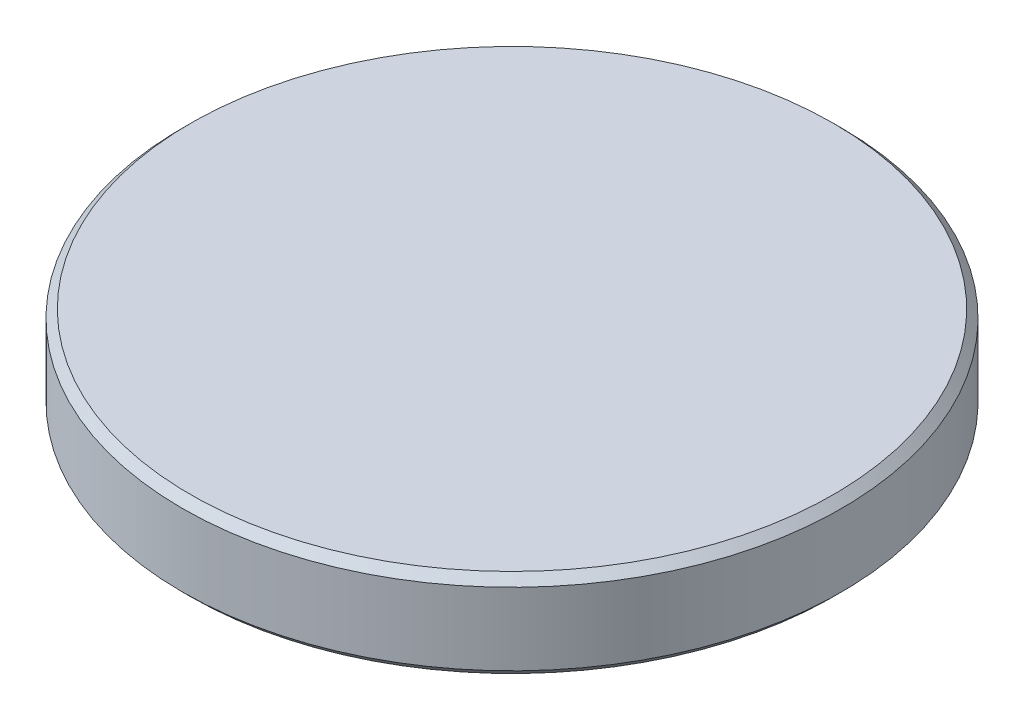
from build123d import *

# Parameters (mm, degrees)
SKETCH1_R      = 20.5
EXTRUDE1_DEPTH = 5.5
CHAMFER1_SIZE  = 0.5
SHELL1_T       = -2
CHAMFER2_SIZE  = 0.5


with BuildPart() as part:
    # Sketch1 → Extrude1 (new body)
    with BuildSketch(Plane(origin=(0, 0, 0), x_dir=(1, 0, 0), z_dir=(0, 1, 0))):
        with Locations(Location((0, 0, 0), (0, 0, 270))):
            Circle(SKETCH1_R)
    extrude(amount=EXTRUDE1_DEPTH)

    # Chamfer1
    chamfer1_edges = [part.edges().sort_by_distance(p)[0] for p in [
        (0, 5.5, -20.5),
    ]]
    chamfer(chamfer1_edges, length=CHAMFER1_SIZE)

    # Shell1
    shell1_openings = [part.faces().sort_by_distance(p)[0] for p in [
        (0, 0, 0),
    ]]
    offset(amount=SHELL1_T, openings=shell1_openings, kind=Kind.INTERSECTION)

    # Chamfer2
    chamfer2_edges = [part.edges().sort_by_distance(p)[0] for p in [
        (0, 0, -20.5),
    ]]
    chamfer(chamfer2_edges, length=CHAMFER2_SIZE)


solid = part.part
